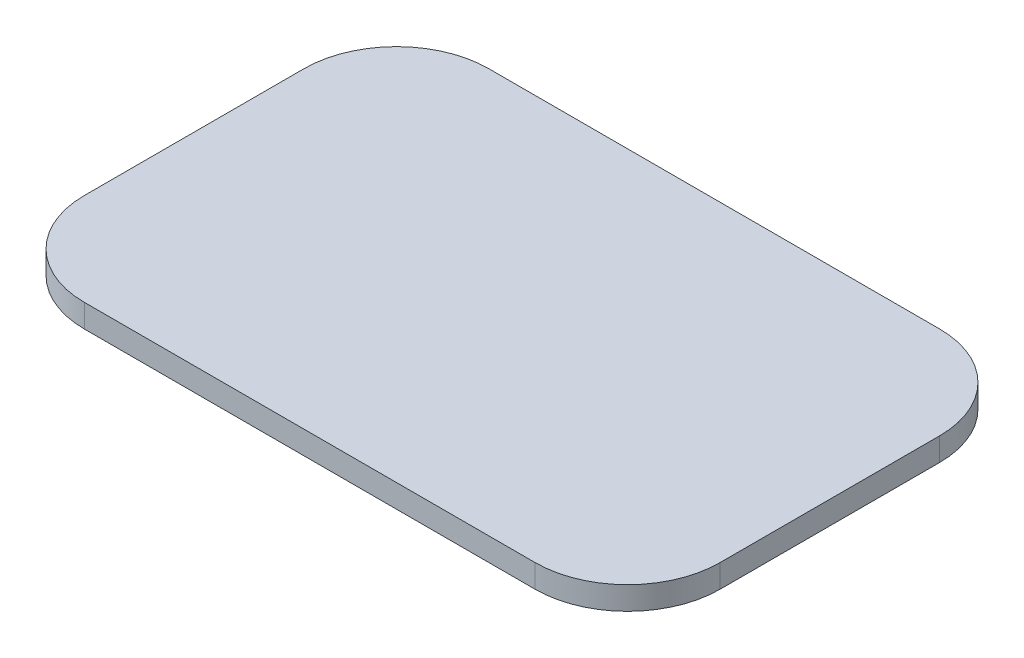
ISO-10303-21;
HEADER;
FILE_DESCRIPTION(('STEP AP214'),'2;1');
FILE_NAME('part.step','',(''),(''),'','','');
FILE_SCHEMA(('AUTOMOTIVE_DESIGN { 1 0 10303 214 1 1 1 1 }'));
ENDSEC;
DATA;
#1=APPLICATION_CONTEXT('core data for automotive mechanical design processes');
#2=APPLICATION_PROTOCOL_DEFINITION('international standard','automotive_design',2000,#1);
#3=PRODUCT_CONTEXT('',#1,'mechanical');
#4=PRODUCT('Part','Part','',(#3));
#5=PRODUCT_RELATED_PRODUCT_CATEGORY('part','',(#4));
#6=PRODUCT_DEFINITION_FORMATION('','',#4);
#7=PRODUCT_DEFINITION_CONTEXT('part definition',#1,'design');
#8=PRODUCT_DEFINITION('design','',#6,#7);
#9=PRODUCT_DEFINITION_SHAPE('','',#8);
#10=(LENGTH_UNIT() NAMED_UNIT(*) SI_UNIT(.MILLI.,.METRE.));
#11=(NAMED_UNIT(*) PLANE_ANGLE_UNIT() SI_UNIT($,.RADIAN.));
#12=(NAMED_UNIT(*) SI_UNIT($,.STERADIAN.) SOLID_ANGLE_UNIT());
#13=UNCERTAINTY_MEASURE_WITH_UNIT(LENGTH_MEASURE(1.E-05),#10,'distance_accuracy_value','');
#14=(GEOMETRIC_REPRESENTATION_CONTEXT(3) GLOBAL_UNCERTAINTY_ASSIGNED_CONTEXT((#13)) GLOBAL_UNIT_ASSIGNED_CONTEXT((#10,
#11,#12)) REPRESENTATION_CONTEXT('',''));
#15=CARTESIAN_POINT('',(0.,0.,0.));
#16=DIRECTION('',(0.,0.,1.));
#17=DIRECTION('',(1.,0.,0.));
#18=AXIS2_PLACEMENT_3D('',#15,#16,#17);
#19=CARTESIAN_POINT('',(19.5,2.,9.5));
#20=DIRECTION('',(0.,-1.,0.));
#21=DIRECTION('',(0.,0.,-1.));
#22=AXIS2_PLACEMENT_3D('',#19,#20,#21);
#23=CYLINDRICAL_SURFACE('',#22,8.);
#24=CARTESIAN_POINT('',(19.5,0.,9.5));
#25=DIRECTION('',(0.,1.,0.));
#26=DIRECTION('',(0.,0.,1.));
#27=AXIS2_PLACEMENT_3D('',#24,#25,#26);
#28=CIRCLE('',#27,8.);
#29=CARTESIAN_POINT('',(19.5,0.,17.5));
#30=VERTEX_POINT('',#29);
#31=CARTESIAN_POINT('',(27.5,0.,9.5));
#32=VERTEX_POINT('',#31);
#33=EDGE_CURVE('E130',#30,#32,#28,.T.);
#34=ORIENTED_EDGE('',*,*,#33,.T.);
#35=DIRECTION('',(0.,-1.,0.));
#36=VECTOR('',#35,1.);
#37=CARTESIAN_POINT('',(27.5,2.,9.5));
#38=LINE('',#37,#36);
#39=CARTESIAN_POINT('',(27.5,2.,9.5));
#40=VERTEX_POINT('',#39);
#41=EDGE_CURVE('E11',#40,#32,#38,.T.);
#42=ORIENTED_EDGE('',*,*,#41,.F.);
#43=CARTESIAN_POINT('',(19.5,2.,9.5));
#44=DIRECTION('',(0.,1.,0.));
#45=DIRECTION('',(0.,0.,1.));
#46=AXIS2_PLACEMENT_3D('',#43,#44,#45);
#47=CIRCLE('',#46,8.);
#48=CARTESIAN_POINT('',(19.5,2.,17.5));
#49=VERTEX_POINT('',#48);
#50=EDGE_CURVE('E144',#49,#40,#47,.T.);
#51=ORIENTED_EDGE('',*,*,#50,.F.);
#52=DIRECTION('',(0.,-1.,0.));
#53=VECTOR('',#52,1.);
#54=CARTESIAN_POINT('',(19.5,2.,17.5));
#55=LINE('',#54,#53);
#56=EDGE_CURVE('E126',#49,#30,#55,.T.);
#57=ORIENTED_EDGE('',*,*,#56,.T.);
#58=EDGE_LOOP('',(#34,#42,#51,#57));
#59=FACE_BOUND('',#58,.T.);
#60=ADVANCED_FACE('F34',(#59),#23,.T.);
#61=CARTESIAN_POINT('',(27.5,2.,9.5));
#62=DIRECTION('',(-1.,0.,0.));
#63=DIRECTION('',(0.,0.,1.));
#64=AXIS2_PLACEMENT_3D('',#61,#62,#63);
#65=PLANE('',#64);
#66=DIRECTION('',(0.,0.,-1.));
#67=VECTOR('',#66,1.);
#68=CARTESIAN_POINT('',(27.5,0.,9.5));
#69=LINE('',#68,#67);
#70=CARTESIAN_POINT('',(27.5,0.,-9.5));
#71=VERTEX_POINT('',#70);
#72=EDGE_CURVE('E133',#32,#71,#69,.T.);
#73=ORIENTED_EDGE('',*,*,#72,.T.);
#74=DIRECTION('',(0.,-1.,0.));
#75=VECTOR('',#74,1.);
#76=CARTESIAN_POINT('',(27.5,2.,-9.5));
#77=LINE('',#76,#75);
#78=CARTESIAN_POINT('',(27.5,2.,-9.5));
#79=VERTEX_POINT('',#78);
#80=EDGE_CURVE('E42',#79,#71,#77,.T.);
#81=ORIENTED_EDGE('',*,*,#80,.F.);
#82=DIRECTION('',(0.,0.,-1.));
#83=VECTOR('',#82,1.);
#84=CARTESIAN_POINT('',(27.5,2.,9.5));
#85=LINE('',#84,#83);
#86=EDGE_CURVE('E93',#40,#79,#85,.T.);
#87=ORIENTED_EDGE('',*,*,#86,.F.);
#88=ORIENTED_EDGE('',*,*,#41,.T.);
#89=EDGE_LOOP('',(#73,#81,#87,#88));
#90=FACE_BOUND('',#89,.T.);
#91=ADVANCED_FACE('F179',(#90),#65,.F.);
#92=CARTESIAN_POINT('',(19.5,2.,-9.5));
#93=DIRECTION('',(0.,-1.,0.));
#94=DIRECTION('',(0.,0.,-1.));
#95=AXIS2_PLACEMENT_3D('',#92,#93,#94);
#96=CYLINDRICAL_SURFACE('',#95,8.);
#97=CARTESIAN_POINT('',(19.5,0.,-9.5));
#98=DIRECTION('',(0.,1.,0.));
#99=DIRECTION('',(0.,0.,-1.));
#100=AXIS2_PLACEMENT_3D('',#97,#98,#99);
#101=CIRCLE('',#100,8.);
#102=CARTESIAN_POINT('',(19.5,0.,-17.5));
#103=VERTEX_POINT('',#102);
#104=EDGE_CURVE('E135',#71,#103,#101,.T.);
#105=ORIENTED_EDGE('',*,*,#104,.T.);
#106=DIRECTION('',(0.,-1.,0.));
#107=VECTOR('',#106,1.);
#108=CARTESIAN_POINT('',(19.5,2.,-17.5));
#109=LINE('',#108,#107);
#110=CARTESIAN_POINT('',(19.5,2.,-17.5));
#111=VERTEX_POINT('',#110);
#112=EDGE_CURVE('E151',#111,#103,#109,.T.);
#113=ORIENTED_EDGE('',*,*,#112,.F.);
#114=CARTESIAN_POINT('',(19.5,2.,-9.5));
#115=DIRECTION('',(0.,1.,0.));
#116=DIRECTION('',(0.,0.,-1.));
#117=AXIS2_PLACEMENT_3D('',#114,#115,#116);
#118=CIRCLE('',#117,8.);
#119=EDGE_CURVE('E159',#79,#111,#118,.T.);
#120=ORIENTED_EDGE('',*,*,#119,.F.);
#121=ORIENTED_EDGE('',*,*,#80,.T.);
#122=EDGE_LOOP('',(#105,#113,#120,#121));
#123=FACE_BOUND('',#122,.T.);
#124=ADVANCED_FACE('F157',(#123),#96,.T.);
#125=CARTESIAN_POINT('',(-19.5,2.,-17.5));
#126=DIRECTION('',(0.,0.,1.));
#127=DIRECTION('',(1.,0.,0.));
#128=AXIS2_PLACEMENT_3D('',#125,#126,#127);
#129=PLANE('',#128);
#130=DIRECTION('',(-1.,0.,0.));
#131=VECTOR('',#130,1.);
#132=CARTESIAN_POINT('',(-19.5,0.,-17.5));
#133=LINE('',#132,#131);
#134=CARTESIAN_POINT('',(-19.5,0.,-17.5));
#135=VERTEX_POINT('',#134);
#136=EDGE_CURVE('E137',#103,#135,#133,.T.);
#137=ORIENTED_EDGE('',*,*,#136,.T.);
#138=DIRECTION('',(0.,-1.,0.));
#139=VECTOR('',#138,1.);
#140=CARTESIAN_POINT('',(-19.5,2.,-17.5));
#141=LINE('',#140,#139);
#142=CARTESIAN_POINT('',(-19.5,2.,-17.5));
#143=VERTEX_POINT('',#142);
#144=EDGE_CURVE('E148',#143,#135,#141,.T.);
#145=ORIENTED_EDGE('',*,*,#144,.F.);
#146=DIRECTION('',(-1.,0.,0.));
#147=VECTOR('',#146,1.);
#148=CARTESIAN_POINT('',(-19.5,2.,-17.5));
#149=LINE('',#148,#147);
#150=EDGE_CURVE('E171',#111,#143,#149,.T.);
#151=ORIENTED_EDGE('',*,*,#150,.F.);
#152=ORIENTED_EDGE('',*,*,#112,.T.);
#153=EDGE_LOOP('',(#137,#145,#151,#152));
#154=FACE_BOUND('',#153,.T.);
#155=ADVANCED_FACE('F167',(#154),#129,.F.);
#156=CARTESIAN_POINT('',(-19.5,2.,-9.5));
#157=DIRECTION('',(0.,-1.,0.));
#158=DIRECTION('',(0.,0.,-1.));
#159=AXIS2_PLACEMENT_3D('',#156,#157,#158);
#160=CYLINDRICAL_SURFACE('',#159,8.);
#161=CARTESIAN_POINT('',(-19.5,0.,-9.5));
#162=DIRECTION('',(0.,1.,0.));
#163=DIRECTION('',(0.,0.,-1.));
#164=AXIS2_PLACEMENT_3D('',#161,#162,#163);
#165=CIRCLE('',#164,8.);
#166=CARTESIAN_POINT('',(-27.5,0.,-9.5));
#167=VERTEX_POINT('',#166);
#168=EDGE_CURVE('E139',#135,#167,#165,.T.);
#169=ORIENTED_EDGE('',*,*,#168,.T.);
#170=DIRECTION('',(0.,-1.,0.));
#171=VECTOR('',#170,1.);
#172=CARTESIAN_POINT('',(-27.5,2.,-9.5));
#173=LINE('',#172,#171);
#174=CARTESIAN_POINT('',(-27.5,2.,-9.5));
#175=VERTEX_POINT('',#174);
#176=EDGE_CURVE('E121',#175,#167,#173,.T.);
#177=ORIENTED_EDGE('',*,*,#176,.F.);
#178=CARTESIAN_POINT('',(-19.5,2.,-9.5));
#179=DIRECTION('',(0.,1.,0.));
#180=DIRECTION('',(0.,0.,-1.));
#181=AXIS2_PLACEMENT_3D('',#178,#179,#180);
#182=CIRCLE('',#181,8.);
#183=EDGE_CURVE('E112',#143,#175,#182,.T.);
#184=ORIENTED_EDGE('',*,*,#183,.F.);
#185=ORIENTED_EDGE('',*,*,#144,.T.);
#186=EDGE_LOOP('',(#169,#177,#184,#185));
#187=FACE_BOUND('',#186,.T.);
#188=ADVANCED_FACE('F170',(#187),#160,.T.);
#189=CARTESIAN_POINT('',(-27.5,2.,9.5));
#190=DIRECTION('',(1.,0.,0.));
#191=DIRECTION('',(0.,0.,-1.));
#192=AXIS2_PLACEMENT_3D('',#189,#190,#191);
#193=PLANE('',#192);
#194=DIRECTION('',(0.,0.,1.));
#195=VECTOR('',#194,1.);
#196=CARTESIAN_POINT('',(-27.5,0.,9.5));
#197=LINE('',#196,#195);
#198=CARTESIAN_POINT('',(-27.5,0.,9.5));
#199=VERTEX_POINT('',#198);
#200=EDGE_CURVE('E120',#167,#199,#197,.T.);
#201=ORIENTED_EDGE('',*,*,#200,.T.);
#202=DIRECTION('',(0.,-1.,0.));
#203=VECTOR('',#202,1.);
#204=CARTESIAN_POINT('',(-27.5,2.,9.5));
#205=LINE('',#204,#203);
#206=CARTESIAN_POINT('',(-27.5,2.,9.5));
#207=VERTEX_POINT('',#206);
#208=EDGE_CURVE('E117',#207,#199,#205,.T.);
#209=ORIENTED_EDGE('',*,*,#208,.F.);
#210=DIRECTION('',(0.,0.,1.));
#211=VECTOR('',#210,1.);
#212=CARTESIAN_POINT('',(-27.5,2.,9.5));
#213=LINE('',#212,#211);
#214=EDGE_CURVE('E106',#175,#207,#213,.T.);
#215=ORIENTED_EDGE('',*,*,#214,.F.);
#216=ORIENTED_EDGE('',*,*,#176,.T.);
#217=EDGE_LOOP('',(#201,#209,#215,#216));
#218=FACE_BOUND('',#217,.T.);
#219=ADVANCED_FACE('F118',(#218),#193,.F.);
#220=CARTESIAN_POINT('',(-19.5,2.,9.5));
#221=DIRECTION('',(0.,-1.,0.));
#222=DIRECTION('',(0.,0.,-1.));
#223=AXIS2_PLACEMENT_3D('',#220,#221,#222);
#224=CYLINDRICAL_SURFACE('',#223,8.);
#225=CARTESIAN_POINT('',(-19.5,0.,9.5));
#226=DIRECTION('',(0.,1.,0.));
#227=DIRECTION('',(0.,0.,-1.));
#228=AXIS2_PLACEMENT_3D('',#225,#226,#227);
#229=CIRCLE('',#228,8.);
#230=CARTESIAN_POINT('',(-19.5,0.,17.5));
#231=VERTEX_POINT('',#230);
#232=EDGE_CURVE('E79',#199,#231,#229,.T.);
#233=ORIENTED_EDGE('',*,*,#232,.T.);
#234=DIRECTION('',(0.,-1.,0.));
#235=VECTOR('',#234,1.);
#236=CARTESIAN_POINT('',(-19.5,2.,17.5));
#237=LINE('',#236,#235);
#238=CARTESIAN_POINT('',(-19.5,2.,17.5));
#239=VERTEX_POINT('',#238);
#240=EDGE_CURVE('E122',#239,#231,#237,.T.);
#241=ORIENTED_EDGE('',*,*,#240,.F.);
#242=CARTESIAN_POINT('',(-19.5,2.,9.5));
#243=DIRECTION('',(0.,1.,0.));
#244=DIRECTION('',(0.,0.,-1.));
#245=AXIS2_PLACEMENT_3D('',#242,#243,#244);
#246=CIRCLE('',#245,8.);
#247=EDGE_CURVE('E110',#207,#239,#246,.T.);
#248=ORIENTED_EDGE('',*,*,#247,.F.);
#249=ORIENTED_EDGE('',*,*,#208,.T.);
#250=EDGE_LOOP('',(#233,#241,#248,#249));
#251=FACE_BOUND('',#250,.T.);
#252=ADVANCED_FACE('F124',(#251),#224,.T.);
#253=CARTESIAN_POINT('',(-19.5,2.,17.5));
#254=DIRECTION('',(0.,0.,-1.));
#255=DIRECTION('',(-1.,0.,0.));
#256=AXIS2_PLACEMENT_3D('',#253,#254,#255);
#257=PLANE('',#256);
#258=DIRECTION('',(1.,0.,0.));
#259=VECTOR('',#258,1.);
#260=CARTESIAN_POINT('',(-19.5,0.,17.5));
#261=LINE('',#260,#259);
#262=EDGE_CURVE('E85',#231,#30,#261,.T.);
#263=ORIENTED_EDGE('',*,*,#262,.T.);
#264=ORIENTED_EDGE('',*,*,#56,.F.);
#265=DIRECTION('',(1.,0.,0.));
#266=VECTOR('',#265,1.);
#267=CARTESIAN_POINT('',(-19.5,2.,17.5));
#268=LINE('',#267,#266);
#269=EDGE_CURVE('E50',#239,#49,#268,.T.);
#270=ORIENTED_EDGE('',*,*,#269,.F.);
#271=ORIENTED_EDGE('',*,*,#240,.T.);
#272=EDGE_LOOP('',(#263,#264,#270,#271));
#273=FACE_BOUND('',#272,.T.);
#274=ADVANCED_FACE('F195',(#273),#257,.F.);
#275=CARTESIAN_POINT('',(19.5,2.,9.5));
#276=DIRECTION('',(0.,1.,0.));
#277=DIRECTION('',(0.,0.,1.));
#278=AXIS2_PLACEMENT_3D('',#275,#276,#277);
#279=PLANE('',#278);
#280=ORIENTED_EDGE('',*,*,#50,.T.);
#281=ORIENTED_EDGE('',*,*,#86,.T.);
#282=ORIENTED_EDGE('',*,*,#119,.T.);
#283=ORIENTED_EDGE('',*,*,#150,.T.);
#284=ORIENTED_EDGE('',*,*,#183,.T.);
#285=ORIENTED_EDGE('',*,*,#214,.T.);
#286=ORIENTED_EDGE('',*,*,#247,.T.);
#287=ORIENTED_EDGE('',*,*,#269,.T.);
#288=EDGE_LOOP('',(#280,#281,#282,#283,#284,#285,#286,#287));
#289=FACE_BOUND('',#288,.T.);
#290=ADVANCED_FACE('F108',(#289),#279,.T.);
#291=CARTESIAN_POINT('',(19.5,0.,9.5));
#292=DIRECTION('',(0.,1.,0.));
#293=DIRECTION('',(0.,0.,1.));
#294=AXIS2_PLACEMENT_3D('',#291,#292,#293);
#295=PLANE('',#294);
#296=ORIENTED_EDGE('',*,*,#33,.F.);
#297=ORIENTED_EDGE('',*,*,#262,.F.);
#298=ORIENTED_EDGE('',*,*,#232,.F.);
#299=ORIENTED_EDGE('',*,*,#200,.F.);
#300=ORIENTED_EDGE('',*,*,#168,.F.);
#301=ORIENTED_EDGE('',*,*,#136,.F.);
#302=ORIENTED_EDGE('',*,*,#104,.F.);
#303=ORIENTED_EDGE('',*,*,#72,.F.);
#304=EDGE_LOOP('',(#296,#297,#298,#299,#300,#301,#302,#303));
#305=FACE_BOUND('',#304,.T.);
#306=ADVANCED_FACE('F163',(#305),#295,.F.);
#307=CLOSED_SHELL('',(#60,#91,#124,#155,#188,#219,#252,#274,#290,#306));
#308=MANIFOLD_SOLID_BREP('B2',#307);
#309=ADVANCED_BREP_SHAPE_REPRESENTATION('',(#18,#308),#14);
#310=SHAPE_DEFINITION_REPRESENTATION(#9,#309);
ENDSEC;
END-ISO-10303-21;
